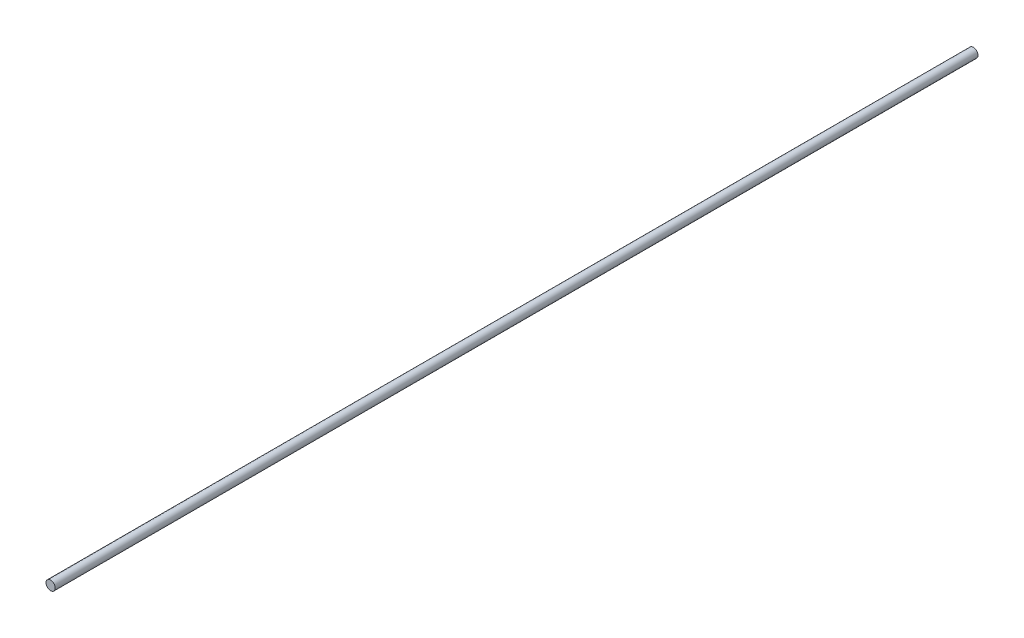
from build123d import *

# Parameters (mm, degrees)
SKETCH1_R           = 30
BOSS_EXTRUDE1_DEPTH = 6000


with BuildPart() as part:
    # Sketch1 → Boss-Extrude1 (new body)
    with BuildSketch(Plane.XY):
        Circle(SKETCH1_R)
    extrude(amount=-BOSS_EXTRUDE1_DEPTH)


solid = part.part
